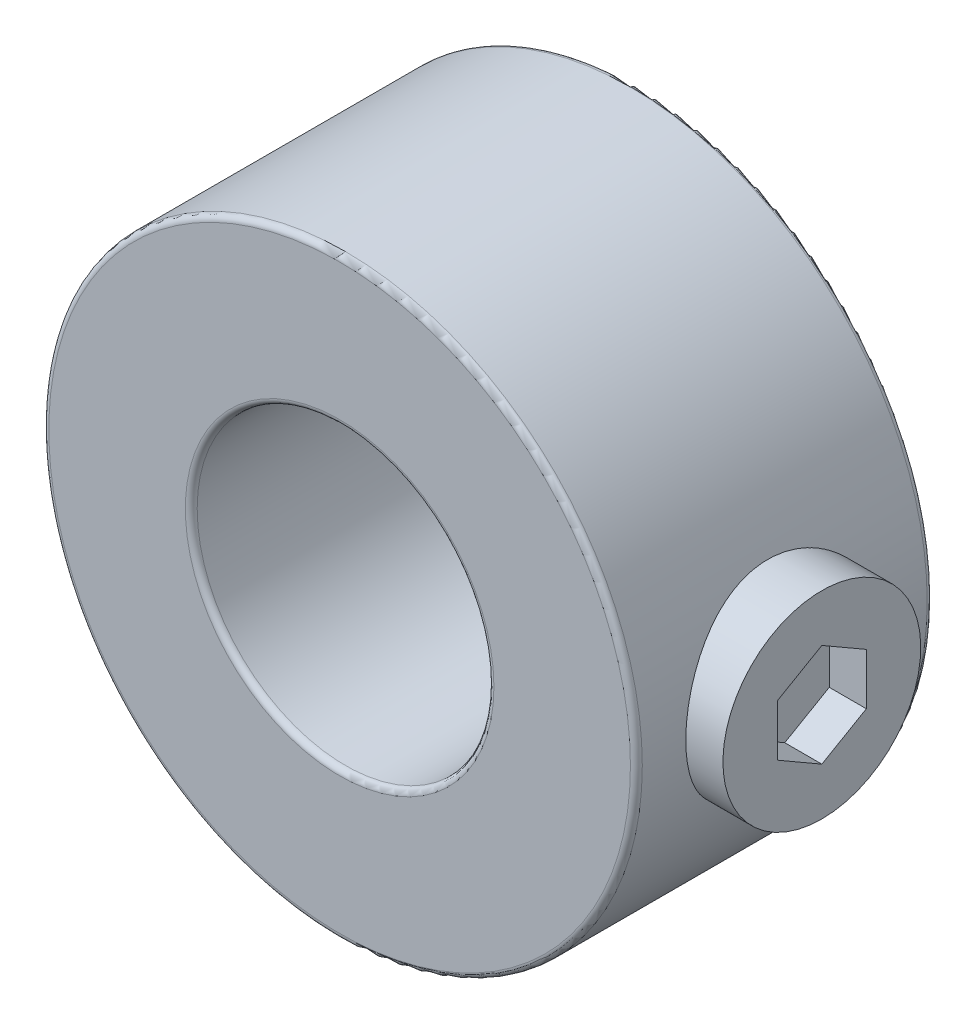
ISO-10303-21;
HEADER;
FILE_DESCRIPTION(('STEP AP214'),'2;1');
FILE_NAME('part.step','',(''),(''),'','','');
FILE_SCHEMA(('AUTOMOTIVE_DESIGN { 1 0 10303 214 1 1 1 1 }'));
ENDSEC;
DATA;
#1=APPLICATION_CONTEXT('core data for automotive mechanical design processes');
#2=APPLICATION_PROTOCOL_DEFINITION('international standard','automotive_design',2000,#1);
#3=PRODUCT_CONTEXT('',#1,'mechanical');
#4=PRODUCT('Part','Part','',(#3));
#5=PRODUCT_RELATED_PRODUCT_CATEGORY('part','',(#4));
#6=PRODUCT_DEFINITION_FORMATION('','',#4);
#7=PRODUCT_DEFINITION_CONTEXT('part definition',#1,'design');
#8=PRODUCT_DEFINITION('design','',#6,#7);
#9=PRODUCT_DEFINITION_SHAPE('','',#8);
#10=(LENGTH_UNIT() NAMED_UNIT(*) SI_UNIT(.MILLI.,.METRE.));
#11=(NAMED_UNIT(*) PLANE_ANGLE_UNIT() SI_UNIT($,.RADIAN.));
#12=(NAMED_UNIT(*) SI_UNIT($,.STERADIAN.) SOLID_ANGLE_UNIT());
#13=UNCERTAINTY_MEASURE_WITH_UNIT(LENGTH_MEASURE(1.E-05),#10,'distance_accuracy_value','');
#14=(GEOMETRIC_REPRESENTATION_CONTEXT(3) GLOBAL_UNCERTAINTY_ASSIGNED_CONTEXT((#13)) GLOBAL_UNIT_ASSIGNED_CONTEXT((#10,
#11,#12)) REPRESENTATION_CONTEXT('',''));
#15=CARTESIAN_POINT('',(0.,0.,0.));
#16=DIRECTION('',(0.,0.,1.));
#17=DIRECTION('',(1.,0.,0.));
#18=AXIS2_PLACEMENT_3D('',#15,#16,#17);
#19=CARTESIAN_POINT('',(5.95312500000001,0.,4.7625));
#20=DIRECTION('',(1.,0.,0.));
#21=DIRECTION('',(0.,1.,0.));
#22=AXIS2_PLACEMENT_3D('',#19,#20,#21);
#23=PLANE('',#22);
#24=CARTESIAN_POINT('',(5.95312500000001,0.,4.7625));
#25=DIRECTION('',(-1.,0.,0.));
#26=DIRECTION('',(0.,-1.,0.));
#27=AXIS2_PLACEMENT_3D('',#24,#25,#26);
#28=CIRCLE('',#27,3.175);
#29=CARTESIAN_POINT('',(5.95312500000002,-3.17500000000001,4.7625));
#30=VERTEX_POINT('',#29);
#31=EDGE_CURVE('E12',#30,#30,#28,.T.);
#32=ORIENTED_EDGE('',*,*,#31,.T.);
#33=EDGE_LOOP('',(#32));
#34=FACE_BOUND('',#33,.T.);
#35=ADVANCED_FACE('F42',(#34),#23,.F.);
#36=CARTESIAN_POINT('',(5.953125,0.,4.7625));
#37=DIRECTION('',(-1.,0.,0.));
#38=DIRECTION('',(0.,-1.,0.));
#39=AXIS2_PLACEMENT_3D('',#36,#37,#38);
#40=CYLINDRICAL_SURFACE('',#39,3.175);
#41=ORIENTED_EDGE('',*,*,#31,.F.);
#42=EDGE_LOOP('',(#41));
#43=FACE_BOUND('',#42,.T.);
#44=CARTESIAN_POINT('',(10.715625,0.,4.7625));
#45=DIRECTION('',(-1.,0.,0.));
#46=DIRECTION('',(0.,-1.,0.));
#47=AXIS2_PLACEMENT_3D('',#44,#45,#46);
#48=CIRCLE('',#47,3.17499999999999);
#49=CARTESIAN_POINT('',(10.715625,-3.17499999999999,4.7625));
#50=VERTEX_POINT('',#49);
#51=EDGE_CURVE('E49',#50,#50,#48,.T.);
#52=ORIENTED_EDGE('',*,*,#51,.T.);
#53=EDGE_LOOP('',(#52));
#54=FACE_BOUND('',#53,.T.);
#55=ADVANCED_FACE('F152',(#43,#54),#40,.T.);
#56=CARTESIAN_POINT('',(10.715625,0.,4.7625));
#57=DIRECTION('',(-1.,0.,0.));
#58=DIRECTION('',(0.,-1.,0.));
#59=AXIS2_PLACEMENT_3D('',#56,#57,#58);
#60=PLANE('',#59);
#61=DIRECTION('',(0.,-0.5,0.866025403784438));
#62=VECTOR('',#61,1.);
#63=CARTESIAN_POINT('',(10.715625,1.64977839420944,4.7625));
#64=LINE('',#63,#62);
#65=CARTESIAN_POINT('',(10.715625,1.64977839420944,4.7625));
#66=VERTEX_POINT('',#65);
#67=CARTESIAN_POINT('',(10.715625,0.824889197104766,6.19125));
#68=VERTEX_POINT('',#67);
#69=EDGE_CURVE('E110',#66,#68,#64,.T.);
#70=ORIENTED_EDGE('',*,*,#69,.F.);
#71=DIRECTION('',(0.,0.5,0.866025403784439));
#72=VECTOR('',#71,1.);
#73=CARTESIAN_POINT('',(10.715625,0.824889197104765,3.33375));
#74=LINE('',#73,#72);
#75=CARTESIAN_POINT('',(10.715625,0.824889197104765,3.33375));
#76=VERTEX_POINT('',#75);
#77=EDGE_CURVE('E56',#76,#66,#74,.T.);
#78=ORIENTED_EDGE('',*,*,#77,.F.);
#79=DIRECTION('',(0.,1.,0.));
#80=VECTOR('',#79,1.);
#81=CARTESIAN_POINT('',(10.715625,-0.82488919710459,3.33375));
#82=LINE('',#81,#80);
#83=CARTESIAN_POINT('',(10.715625,-0.82488919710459,3.33375));
#84=VERTEX_POINT('',#83);
#85=EDGE_CURVE('E126',#84,#76,#82,.T.);
#86=ORIENTED_EDGE('',*,*,#85,.F.);
#87=DIRECTION('',(0.,0.5,-0.866025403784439));
#88=VECTOR('',#87,1.);
#89=CARTESIAN_POINT('',(10.715625,-1.64977839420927,4.7625));
#90=LINE('',#89,#88);
#91=CARTESIAN_POINT('',(10.715625,-1.64977839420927,4.7625));
#92=VERTEX_POINT('',#91);
#93=EDGE_CURVE('E120',#92,#84,#90,.T.);
#94=ORIENTED_EDGE('',*,*,#93,.F.);
#95=DIRECTION('',(0.,-0.5,-0.866025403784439));
#96=VECTOR('',#95,1.);
#97=CARTESIAN_POINT('',(10.715625,-0.82488919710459,6.19125));
#98=LINE('',#97,#96);
#99=CARTESIAN_POINT('',(10.715625,-0.82488919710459,6.19125));
#100=VERTEX_POINT('',#99);
#101=EDGE_CURVE('E118',#100,#92,#98,.T.);
#102=ORIENTED_EDGE('',*,*,#101,.F.);
#103=DIRECTION('',(0.,-1.,0.));
#104=VECTOR('',#103,1.);
#105=CARTESIAN_POINT('',(10.715625,0.824889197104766,6.19125));
#106=LINE('',#105,#104);
#107=EDGE_CURVE('E99',#68,#100,#106,.T.);
#108=ORIENTED_EDGE('',*,*,#107,.F.);
#109=EDGE_LOOP('',(#70,#78,#86,#94,#102,#108));
#110=FACE_BOUND('',#109,.T.);
#111=ORIENTED_EDGE('',*,*,#51,.F.);
#112=EDGE_LOOP('',(#111));
#113=FACE_BOUND('',#112,.T.);
#114=ADVANCED_FACE('F114',(#110,#113),#60,.F.);
#115=CARTESIAN_POINT('',(9.52500000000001,0.824889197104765,3.33375));
#116=DIRECTION('',(0.,0.866025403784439,-0.5));
#117=DIRECTION('',(0.,0.5,0.866025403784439));
#118=AXIS2_PLACEMENT_3D('',#115,#116,#117);
#119=PLANE('',#118);
#120=ORIENTED_EDGE('',*,*,#77,.T.);
#121=DIRECTION('',(1.,0.,0.));
#122=VECTOR('',#121,1.);
#123=CARTESIAN_POINT('',(9.52500000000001,1.64977839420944,4.7625));
#124=LINE('',#123,#122);
#125=CARTESIAN_POINT('',(9.52500000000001,1.64977839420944,4.7625));
#126=VERTEX_POINT('',#125);
#127=EDGE_CURVE('E107',#126,#66,#124,.T.);
#128=ORIENTED_EDGE('',*,*,#127,.F.);
#129=DIRECTION('',(0.,0.5,0.866025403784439));
#130=VECTOR('',#129,1.);
#131=CARTESIAN_POINT('',(9.52500000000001,0.824889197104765,3.33375));
#132=LINE('',#131,#130);
#133=CARTESIAN_POINT('',(9.52500000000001,0.824889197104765,3.33375));
#134=VERTEX_POINT('',#133);
#135=EDGE_CURVE('E128',#134,#126,#132,.T.);
#136=ORIENTED_EDGE('',*,*,#135,.F.);
#137=DIRECTION('',(1.,0.,0.));
#138=VECTOR('',#137,1.);
#139=CARTESIAN_POINT('',(9.52500000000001,0.824889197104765,3.33375));
#140=LINE('',#139,#138);
#141=EDGE_CURVE('E63',#134,#76,#140,.T.);
#142=ORIENTED_EDGE('',*,*,#141,.T.);
#143=EDGE_LOOP('',(#120,#128,#136,#142));
#144=FACE_BOUND('',#143,.T.);
#145=ADVANCED_FACE('F154',(#144),#119,.F.);
#146=CARTESIAN_POINT('',(9.52500000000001,-0.82488919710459,3.33375));
#147=DIRECTION('',(0.,0.,-1.));
#148=DIRECTION('',(-1.,0.,0.));
#149=AXIS2_PLACEMENT_3D('',#146,#147,#148);
#150=PLANE('',#149);
#151=ORIENTED_EDGE('',*,*,#85,.T.);
#152=ORIENTED_EDGE('',*,*,#141,.F.);
#153=DIRECTION('',(0.,1.,0.));
#154=VECTOR('',#153,1.);
#155=CARTESIAN_POINT('',(9.52500000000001,-0.82488919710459,3.33375));
#156=LINE('',#155,#154);
#157=CARTESIAN_POINT('',(9.52500000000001,-0.82488919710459,3.33375));
#158=VERTEX_POINT('',#157);
#159=EDGE_CURVE('E140',#158,#134,#156,.T.);
#160=ORIENTED_EDGE('',*,*,#159,.F.);
#161=DIRECTION('',(1.,0.,0.));
#162=VECTOR('',#161,1.);
#163=CARTESIAN_POINT('',(9.52500000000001,-0.82488919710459,3.33375));
#164=LINE('',#163,#162);
#165=EDGE_CURVE('E144',#158,#84,#164,.T.);
#166=ORIENTED_EDGE('',*,*,#165,.T.);
#167=EDGE_LOOP('',(#151,#152,#160,#166));
#168=FACE_BOUND('',#167,.T.);
#169=ADVANCED_FACE('F160',(#168),#150,.F.);
#170=CARTESIAN_POINT('',(9.52500000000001,-1.64977839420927,4.7625));
#171=DIRECTION('',(0.,-0.866025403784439,-0.5));
#172=DIRECTION('',(0.,0.5,-0.866025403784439));
#173=AXIS2_PLACEMENT_3D('',#170,#171,#172);
#174=PLANE('',#173);
#175=ORIENTED_EDGE('',*,*,#93,.T.);
#176=ORIENTED_EDGE('',*,*,#165,.F.);
#177=DIRECTION('',(0.,0.5,-0.866025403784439));
#178=VECTOR('',#177,1.);
#179=CARTESIAN_POINT('',(9.52500000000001,-1.64977839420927,4.7625));
#180=LINE('',#179,#178);
#181=CARTESIAN_POINT('',(9.52500000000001,-1.64977839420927,4.7625));
#182=VERTEX_POINT('',#181);
#183=EDGE_CURVE('E137',#182,#158,#180,.T.);
#184=ORIENTED_EDGE('',*,*,#183,.F.);
#185=DIRECTION('',(1.,0.,0.));
#186=VECTOR('',#185,1.);
#187=CARTESIAN_POINT('',(9.52500000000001,-1.64977839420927,4.7625));
#188=LINE('',#187,#186);
#189=EDGE_CURVE('E146',#182,#92,#188,.T.);
#190=ORIENTED_EDGE('',*,*,#189,.T.);
#191=EDGE_LOOP('',(#175,#176,#184,#190));
#192=FACE_BOUND('',#191,.T.);
#193=ADVANCED_FACE('F191',(#192),#174,.F.);
#194=CARTESIAN_POINT('',(9.52500000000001,-0.82488919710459,6.19125));
#195=DIRECTION('',(0.,-0.866025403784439,0.5));
#196=DIRECTION('',(0.,-0.5,-0.866025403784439));
#197=AXIS2_PLACEMENT_3D('',#194,#195,#196);
#198=PLANE('',#197);
#199=ORIENTED_EDGE('',*,*,#101,.T.);
#200=ORIENTED_EDGE('',*,*,#189,.F.);
#201=DIRECTION('',(0.,-0.5,-0.866025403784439));
#202=VECTOR('',#201,1.);
#203=CARTESIAN_POINT('',(9.52500000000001,-0.82488919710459,6.19125));
#204=LINE('',#203,#202);
#205=CARTESIAN_POINT('',(9.52500000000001,-0.82488919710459,6.19125));
#206=VERTEX_POINT('',#205);
#207=EDGE_CURVE('E134',#206,#182,#204,.T.);
#208=ORIENTED_EDGE('',*,*,#207,.F.);
#209=DIRECTION('',(1.,0.,0.));
#210=VECTOR('',#209,1.);
#211=CARTESIAN_POINT('',(9.52500000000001,-0.82488919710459,6.19125));
#212=LINE('',#211,#210);
#213=EDGE_CURVE('E106',#206,#100,#212,.T.);
#214=ORIENTED_EDGE('',*,*,#213,.T.);
#215=EDGE_LOOP('',(#199,#200,#208,#214));
#216=FACE_BOUND('',#215,.T.);
#217=ADVANCED_FACE('F200',(#216),#198,.F.);
#218=CARTESIAN_POINT('',(9.52500000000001,0.824889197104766,6.19125));
#219=DIRECTION('',(0.,0.,1.));
#220=DIRECTION('',(1.,0.,0.));
#221=AXIS2_PLACEMENT_3D('',#218,#219,#220);
#222=PLANE('',#221);
#223=ORIENTED_EDGE('',*,*,#107,.T.);
#224=ORIENTED_EDGE('',*,*,#213,.F.);
#225=DIRECTION('',(0.,-1.,0.));
#226=VECTOR('',#225,1.);
#227=CARTESIAN_POINT('',(9.52500000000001,0.824889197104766,6.19125));
#228=LINE('',#227,#226);
#229=CARTESIAN_POINT('',(9.52500000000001,0.824889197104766,6.19125));
#230=VERTEX_POINT('',#229);
#231=EDGE_CURVE('E102',#230,#206,#228,.T.);
#232=ORIENTED_EDGE('',*,*,#231,.F.);
#233=DIRECTION('',(1.,0.,0.));
#234=VECTOR('',#233,1.);
#235=CARTESIAN_POINT('',(9.52500000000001,0.824889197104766,6.19125));
#236=LINE('',#235,#234);
#237=EDGE_CURVE('E95',#230,#68,#236,.T.);
#238=ORIENTED_EDGE('',*,*,#237,.T.);
#239=EDGE_LOOP('',(#223,#224,#232,#238));
#240=FACE_BOUND('',#239,.T.);
#241=ADVANCED_FACE('F97',(#240),#222,.F.);
#242=CARTESIAN_POINT('',(9.52500000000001,1.64977839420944,4.7625));
#243=DIRECTION('',(0.,0.866025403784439,0.5));
#244=DIRECTION('',(0.,-0.5,0.866025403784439));
#245=AXIS2_PLACEMENT_3D('',#242,#243,#244);
#246=PLANE('',#245);
#247=ORIENTED_EDGE('',*,*,#69,.T.);
#248=ORIENTED_EDGE('',*,*,#237,.F.);
#249=DIRECTION('',(0.,-0.5,0.866025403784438));
#250=VECTOR('',#249,1.);
#251=CARTESIAN_POINT('',(9.52500000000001,1.64977839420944,4.7625));
#252=LINE('',#251,#250);
#253=EDGE_CURVE('E131',#126,#230,#252,.T.);
#254=ORIENTED_EDGE('',*,*,#253,.F.);
#255=ORIENTED_EDGE('',*,*,#127,.T.);
#256=EDGE_LOOP('',(#247,#248,#254,#255));
#257=FACE_BOUND('',#256,.T.);
#258=ADVANCED_FACE('F111',(#257),#246,.F.);
#259=CARTESIAN_POINT('',(9.52500000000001,2.47466759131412,6.19125));
#260=DIRECTION('',(1.,0.,0.));
#261=DIRECTION('',(0.,0.,-1.));
#262=AXIS2_PLACEMENT_3D('',#259,#260,#261);
#263=PLANE('',#262);
#264=ORIENTED_EDGE('',*,*,#135,.T.);
#265=ORIENTED_EDGE('',*,*,#253,.T.);
#266=ORIENTED_EDGE('',*,*,#231,.T.);
#267=ORIENTED_EDGE('',*,*,#207,.T.);
#268=ORIENTED_EDGE('',*,*,#183,.T.);
#269=ORIENTED_EDGE('',*,*,#159,.T.);
#270=EDGE_LOOP('',(#264,#265,#266,#267,#268,#269));
#271=FACE_BOUND('',#270,.T.);
#272=ADVANCED_FACE('F227',(#271),#263,.T.);
#273=CLOSED_SHELL('',(#35,#55,#114,#145,#169,#193,#217,#241,#258,#272));
#274=MANIFOLD_SOLID_BREP('B2',#273);
#275=CARTESIAN_POINT('',(0.,0.,9.525));
#276=DIRECTION('',(0.,0.,1.));
#277=DIRECTION('',(1.,0.,0.));
#278=AXIS2_PLACEMENT_3D('',#275,#276,#277);
#279=PLANE('',#278);
#280=CARTESIAN_POINT('',(0.,0.,9.525));
#281=DIRECTION('',(0.,0.,1.));
#282=DIRECTION('',(1.,0.,0.));
#283=AXIS2_PLACEMENT_3D('',#280,#281,#282);
#284=CIRCLE('',#283,4.953);
#285=CARTESIAN_POINT('',(4.953,0.,9.525));
#286=VERTEX_POINT('',#285);
#287=EDGE_CURVE('E259',#286,#286,#284,.F.);
#288=ORIENTED_EDGE('',*,*,#287,.T.);
#289=EDGE_LOOP('',(#288));
#290=FACE_BOUND('',#289,.T.);
#291=CARTESIAN_POINT('',(0.,0.,9.525));
#292=DIRECTION('',(0.,0.,1.));
#293=DIRECTION('',(1.,0.,0.));
#294=AXIS2_PLACEMENT_3D('',#291,#292,#293);
#295=CIRCLE('',#294,9.33450000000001);
#296=CARTESIAN_POINT('',(9.33450000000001,0.,9.525));
#297=VERTEX_POINT('',#296);
#298=EDGE_CURVE('E263',#297,#297,#295,.T.);
#299=ORIENTED_EDGE('',*,*,#298,.T.);
#300=EDGE_LOOP('',(#299));
#301=FACE_BOUND('',#300,.T.);
#302=ADVANCED_FACE('F247',(#290,#301),#279,.T.);
#303=CARTESIAN_POINT('',(0.,0.,0.));
#304=DIRECTION('',(0.,0.,1.));
#305=DIRECTION('',(1.,0.,0.));
#306=AXIS2_PLACEMENT_3D('',#303,#304,#305);
#307=PLANE('',#306);
#308=CARTESIAN_POINT('',(0.,0.,0.));
#309=DIRECTION('',(0.,0.,1.));
#310=DIRECTION('',(1.,0.,0.));
#311=AXIS2_PLACEMENT_3D('',#308,#309,#310);
#312=CIRCLE('',#311,4.953);
#313=CARTESIAN_POINT('',(4.953,0.,0.));
#314=VERTEX_POINT('',#313);
#315=EDGE_CURVE('E274',#314,#314,#312,.T.);
#316=ORIENTED_EDGE('',*,*,#315,.T.);
#317=EDGE_LOOP('',(#316));
#318=FACE_BOUND('',#317,.T.);
#319=CARTESIAN_POINT('',(0.,0.,0.));
#320=DIRECTION('',(0.,0.,1.));
#321=DIRECTION('',(1.,0.,0.));
#322=AXIS2_PLACEMENT_3D('',#319,#320,#321);
#323=CIRCLE('',#322,9.33450000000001);
#324=CARTESIAN_POINT('',(9.33450000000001,0.,0.));
#325=VERTEX_POINT('',#324);
#326=EDGE_CURVE('E277',#325,#325,#323,.F.);
#327=ORIENTED_EDGE('',*,*,#326,.T.);
#328=EDGE_LOOP('',(#327));
#329=FACE_BOUND('',#328,.T.);
#330=ADVANCED_FACE('F318',(#318,#329),#307,.F.);
#331=CARTESIAN_POINT('',(0.,0.,9.525));
#332=DIRECTION('',(0.,0.,-1.));
#333=DIRECTION('',(-1.,0.,0.));
#334=AXIS2_PLACEMENT_3D('',#331,#332,#333);
#335=CYLINDRICAL_SURFACE('',#334,9.52500000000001);
#336=CARTESIAN_POINT('',(0.,0.,0.1905));
#337=DIRECTION('',(0.,0.,1.));
#338=DIRECTION('',(1.,0.,0.));
#339=AXIS2_PLACEMENT_3D('',#336,#337,#338);
#340=CIRCLE('',#339,9.52500000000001);
#341=CARTESIAN_POINT('',(9.52500000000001,0.,0.1905));
#342=VERTEX_POINT('',#341);
#343=EDGE_CURVE('E41',#342,#342,#340,.T.);
#344=ORIENTED_EDGE('',*,*,#343,.T.);
#345=EDGE_LOOP('',(#344));
#346=FACE_BOUND('',#345,.T.);
#347=CARTESIAN_POINT('',(0.,0.,9.3345));
#348=DIRECTION('',(0.,0.,1.));
#349=DIRECTION('',(1.,0.,0.));
#350=AXIS2_PLACEMENT_3D('',#347,#348,#349);
#351=CIRCLE('',#350,9.52500000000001);
#352=CARTESIAN_POINT('',(9.52500000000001,0.,9.3345));
#353=VERTEX_POINT('',#352);
#354=EDGE_CURVE('E255',#353,#353,#351,.F.);
#355=ORIENTED_EDGE('',*,*,#354,.T.);
#356=EDGE_LOOP('',(#355));
#357=FACE_BOUND('',#356,.T.);
#358=CARTESIAN_POINT('',(9.525,0.,1.5875));
#359=CARTESIAN_POINT('',(9.52500048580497,-0.173238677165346,1.58749919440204));
#360=CARTESIAN_POINT('',(9.52023018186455,-0.346472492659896,1.60172484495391));
#361=CARTESIAN_POINT('',(9.50167042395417,-0.687837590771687,1.65807742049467));
#362=CARTESIAN_POINT('',(9.48788003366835,-0.855968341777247,1.70020724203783));
#363=CARTESIAN_POINT('',(9.45277852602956,-1.18215660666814,1.81076359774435));
#364=CARTESIAN_POINT('',(9.4314799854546,-1.34023044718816,1.87914617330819));
#365=CARTESIAN_POINT('',(9.38353615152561,-1.64266542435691,2.04006822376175));
#366=CARTESIAN_POINT('',(9.35688980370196,-1.78702384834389,2.13261246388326));
#367=CARTESIAN_POINT('',(9.30002249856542,-2.0629298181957,2.34259693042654));
#368=CARTESIAN_POINT('',(9.26971591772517,-2.19393674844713,2.46072416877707));
#369=CARTESIAN_POINT('',(9.20941499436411,-2.43469379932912,2.71706071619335));
#370=CARTESIAN_POINT('',(9.17942072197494,-2.54443923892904,2.85527443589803));
#371=CARTESIAN_POINT('',(9.12219830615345,-2.74264419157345,3.15272774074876));
#372=CARTESIAN_POINT('',(9.09507449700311,-2.83040092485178,3.31245762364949));
#373=CARTESIAN_POINT('',(9.04796594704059,-2.97757492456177,3.64545909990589));
#374=CARTESIAN_POINT('',(9.02797902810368,-3.03700083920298,3.81872654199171));
#375=CARTESIAN_POINT('',(8.99830887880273,-3.12379824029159,4.16773747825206));
#376=CARTESIAN_POINT('',(8.98830104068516,-3.15218269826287,4.34320063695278));
#377=CARTESIAN_POINT('',(8.97876209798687,-3.17925806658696,4.69666241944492));
#378=CARTESIAN_POINT('',(8.97922775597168,-3.17795815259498,4.87466024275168));
#379=CARTESIAN_POINT('',(8.99029872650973,-3.14648819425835,5.21949880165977));
#380=CARTESIAN_POINT('',(9.00043970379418,-3.11764017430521,5.38647767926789));
#381=CARTESIAN_POINT('',(9.0289588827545,-3.0340495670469,5.7130741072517));
#382=CARTESIAN_POINT('',(9.04733807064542,-2.97930387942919,5.87269077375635));
#383=CARTESIAN_POINT('',(9.09059367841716,-2.84460650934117,6.18303547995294));
#384=CARTESIAN_POINT('',(9.11556996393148,-2.76426310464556,6.33357898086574));
#385=CARTESIAN_POINT('',(9.16916373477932,-2.58092291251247,6.61946513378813));
#386=CARTESIAN_POINT('',(9.19778227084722,-2.47791958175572,6.75480337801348));
#387=CARTESIAN_POINT('',(9.25726270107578,-2.2458341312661,7.01386582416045));
#388=CARTESIAN_POINT('',(9.28816371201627,-2.11567125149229,7.1366148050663));
#389=CARTESIAN_POINT('',(9.34742029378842,-1.83622813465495,7.35879677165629));
#390=CARTESIAN_POINT('',(9.37577562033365,-1.68694606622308,7.45822752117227));
#391=CARTESIAN_POINT('',(9.42711817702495,-1.3714336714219,7.63173575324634));
#392=CARTESIAN_POINT('',(9.45004936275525,-1.20504990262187,7.70555193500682));
#393=CARTESIAN_POINT('',(9.48755300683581,-0.86127933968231,7.82384507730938));
#394=CARTESIAN_POINT('',(9.50212836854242,-0.683896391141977,7.86833222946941));
#395=CARTESIAN_POINT('',(9.52079715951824,-0.33141865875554,7.92497673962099));
#396=CARTESIAN_POINT('',(9.52531755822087,-0.156557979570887,7.93845189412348));
#397=CARTESIAN_POINT('',(9.52464766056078,0.192960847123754,7.93644376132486));
#398=CARTESIAN_POINT('',(9.51945900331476,0.36761902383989,7.92096536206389));
#399=CARTESIAN_POINT('',(9.50023578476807,0.706500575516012,7.86253219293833));
#400=CARTESIAN_POINT('',(9.48646180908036,0.870879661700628,7.82038629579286));
#401=CARTESIAN_POINT('',(9.45171613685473,1.19016766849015,7.71082581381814));
#402=CARTESIAN_POINT('',(9.43074352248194,1.34507537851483,7.64340800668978));
#403=CARTESIAN_POINT('',(9.38304356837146,1.64556534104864,7.4832513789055));
#404=CARTESIAN_POINT('',(9.35617936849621,1.79079512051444,7.38989316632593));
#405=CARTESIAN_POINT('',(9.29974181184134,2.06395583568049,7.18123357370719));
#406=CARTESIAN_POINT('',(9.27016762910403,2.19188146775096,7.06592549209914));
#407=CARTESIAN_POINT('',(9.20993992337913,2.432851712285,6.81044246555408));
#408=CARTESIAN_POINT('',(9.17929841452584,2.54495607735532,6.66937570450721));
#409=CARTESIAN_POINT('',(9.12177415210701,2.74401763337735,6.36977527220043));
#410=CARTESIAN_POINT('',(9.09489142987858,2.83097461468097,6.2112414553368));
#411=CARTESIAN_POINT('',(9.04819093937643,2.97687025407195,5.88113817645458));
#412=CARTESIAN_POINT('',(9.02835890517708,3.03586556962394,5.70959589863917));
#413=CARTESIAN_POINT('',(8.99829392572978,3.12386556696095,5.35819778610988));
#414=CARTESIAN_POINT('',(8.98805665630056,3.15288375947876,5.17834573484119));
#415=CARTESIAN_POINT('',(8.97883201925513,3.17905219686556,4.82537422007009));
#416=CARTESIAN_POINT('',(8.97929370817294,3.17776306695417,4.65238356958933));
#417=CARTESIAN_POINT('',(8.9900528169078,3.1471942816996,4.30922088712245));
#418=CARTESIAN_POINT('',(9.00034965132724,3.11791629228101,4.13904868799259));
#419=CARTESIAN_POINT('',(9.02920864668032,3.03330550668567,3.80956926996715));
#420=CARTESIAN_POINT('',(9.04761011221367,2.97847812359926,3.65011708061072));
#421=CARTESIAN_POINT('',(9.09054566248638,2.8447344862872,3.34255298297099));
#422=CARTESIAN_POINT('',(9.11508110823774,2.76581288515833,3.19444360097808));
#423=CARTESIAN_POINT('',(9.16885482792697,2.58210269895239,2.90676434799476));
#424=CARTESIAN_POINT('',(9.19825159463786,2.47633567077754,2.76784910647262));
#425=CARTESIAN_POINT('',(9.25777156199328,2.24359115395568,2.50923484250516));
#426=CARTESIAN_POINT('',(9.28789496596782,2.11660766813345,2.38954127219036));
#427=CARTESIAN_POINT('',(9.34688346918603,1.83909194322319,2.16806649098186));
#428=CARTESIAN_POINT('',(9.3756537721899,1.68783480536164,2.06716519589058));
#429=CARTESIAN_POINT('',(9.42740021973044,1.36955960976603,1.8923303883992));
#430=CARTESIAN_POINT('',(9.45037784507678,1.20254559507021,1.81838998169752));
#431=CARTESIAN_POINT('',(9.48707510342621,0.865167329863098,1.70268381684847));
#432=CARTESIAN_POINT('',(9.5011624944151,0.695286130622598,1.65962816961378));
#433=CARTESIAN_POINT('',(9.52012342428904,0.350267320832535,1.60204060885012));
#434=CARTESIAN_POINT('',(9.52499950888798,0.17513117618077,1.5875008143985));
#435=CARTESIAN_POINT('',(9.525,0.,1.5875));
#436=B_SPLINE_CURVE_WITH_KNOTS('',3,(#358,#359,#360,#361,#362,#363,#364,#365,#366,#367,#368,
#369,#370,#371,#372,#373,#374,#375,#376,#377,#378,#379,#380,#381,#382,#383,#384,#385,#386,#387,
#388,#389,#390,#391,#392,#393,#394,#395,#396,#397,#398,#399,#400,#401,#402,#403,#404,#405,#406,
#407,#408,#409,#410,#411,#412,#413,#414,#415,#416,#417,#418,#419,#420,#421,#422,#423,#424,#425,
#426,#427,#428,#429,#430,#431,#432,#433,#434,#435),.UNSPECIFIED.,.T.,.F.,(4,2,2,2,2,2,2,2,2,2,2,
2,2,2,2,2,2,2,2,2,2,2,2,2,2,2,2,2,2,2,2,2,2,2,2,2,2,2,4),(0.,0.519071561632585,1.03819701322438,
1.55645698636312,2.07481924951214,2.6093637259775,3.14402575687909,3.69406121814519,
4.24392866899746,4.77526114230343,5.30642937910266,5.81332424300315,6.32027980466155,
6.8353994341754,7.35066800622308,7.8928374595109,8.43505888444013,8.98265937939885,
9.53006948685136,10.0537512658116,10.5773446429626,11.0857715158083,11.5942632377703,
12.1161301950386,12.638156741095,13.1839024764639,13.7296527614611,14.274292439,
14.8186865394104,15.3351123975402,15.8515075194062,16.3580948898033,16.8647947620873,
17.3936046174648,17.92256420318,18.4721392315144,19.0215736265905,19.5464607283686,
20.0712027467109),.UNSPECIFIED.);
#437=CARTESIAN_POINT('',(9.525,0.,1.5875));
#438=VERTEX_POINT('',#437);
#439=EDGE_CURVE('E280',#438,#438,#436,.T.);
#440=ORIENTED_EDGE('',*,*,#439,.T.);
#441=EDGE_LOOP('',(#440));
#442=FACE_BOUND('',#441,.T.);
#443=ADVANCED_FACE('F249',(#346,#357,#442),#335,.T.);
#444=CARTESIAN_POINT('',(0.,0.,9.525));
#445=DIRECTION('',(0.,0.,-1.));
#446=DIRECTION('',(-1.,0.,0.));
#447=AXIS2_PLACEMENT_3D('',#444,#445,#446);
#448=CYLINDRICAL_SURFACE('',#447,4.7625);
#449=CARTESIAN_POINT('',(0.,0.,0.1905));
#450=DIRECTION('',(0.,0.,1.));
#451=DIRECTION('',(1.,0.,0.));
#452=AXIS2_PLACEMENT_3D('',#449,#450,#451);
#453=CIRCLE('',#452,4.7625);
#454=CARTESIAN_POINT('',(4.7625,0.,0.1905));
#455=VERTEX_POINT('',#454);
#456=EDGE_CURVE('E268',#455,#455,#453,.F.);
#457=ORIENTED_EDGE('',*,*,#456,.T.);
#458=EDGE_LOOP('',(#457));
#459=FACE_BOUND('',#458,.T.);
#460=CARTESIAN_POINT('',(0.,0.,9.3345));
#461=DIRECTION('',(0.,0.,1.));
#462=DIRECTION('',(1.,0.,0.));
#463=AXIS2_PLACEMENT_3D('',#460,#461,#462);
#464=CIRCLE('',#463,4.7625);
#465=CARTESIAN_POINT('',(4.7625,0.,9.3345));
#466=VERTEX_POINT('',#465);
#467=EDGE_CURVE('E271',#466,#466,#464,.T.);
#468=ORIENTED_EDGE('',*,*,#467,.T.);
#469=EDGE_LOOP('',(#468));
#470=FACE_BOUND('',#469,.T.);
#471=CARTESIAN_POINT('',(4.7625,0.,1.5875));
#472=CARTESIAN_POINT('',(4.76249829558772,-0.159513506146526,1.58750214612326));
#473=CARTESIAN_POINT('',(4.75441585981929,-0.319036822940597,1.59958798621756));
#474=CARTESIAN_POINT('',(4.72288699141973,-0.632990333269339,1.6471842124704));
#475=CARTESIAN_POINT('',(4.6994332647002,-0.787418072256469,1.6827057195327));
#476=CARTESIAN_POINT('',(4.63947623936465,-1.08618661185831,1.77499621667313));
#477=CARTESIAN_POINT('',(4.60303407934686,-1.23057094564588,1.83166571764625));
#478=CARTESIAN_POINT('',(4.52002748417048,-1.50719688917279,1.96383803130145));
#479=CARTESIAN_POINT('',(4.47346157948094,-1.63943673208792,2.03934357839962));
#480=CARTESIAN_POINT('',(4.36923384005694,-1.9006894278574,2.21401790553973));
#481=CARTESIAN_POINT('',(4.31096574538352,-2.0284762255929,2.31465098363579));
#482=CARTESIAN_POINT('',(4.19071922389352,-2.26651828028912,2.53322144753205));
#483=CARTESIAN_POINT('',(4.12873555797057,-2.37674794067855,2.65118362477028));
#484=CARTESIAN_POINT('',(3.99618620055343,-2.59432897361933,2.92267063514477));
#485=CARTESIAN_POINT('',(3.92580920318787,-2.69848308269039,3.07886997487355));
#486=CARTESIAN_POINT('',(3.79546083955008,-2.87893691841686,3.41052686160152));
#487=CARTESIAN_POINT('',(3.73547157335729,-2.95528481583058,3.58595041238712));
#488=CARTESIAN_POINT('',(3.65087323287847,-3.0587003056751,3.90002917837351));
#489=CARTESIAN_POINT('',(3.62104984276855,-3.09363184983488,4.03467641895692));
#490=CARTESIAN_POINT('',(3.57597026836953,-3.14564105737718,4.30965690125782));
#491=CARTESIAN_POINT('',(3.56068897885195,-3.16274949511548,4.44997990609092));
#492=CARTESIAN_POINT('',(3.54705611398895,-3.17803790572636,4.73309121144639));
#493=CARTESIAN_POINT('',(3.54877374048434,-3.17614050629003,4.87588722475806));
#494=CARTESIAN_POINT('',(3.56901393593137,-3.1533716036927,5.15879552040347));
#495=CARTESIAN_POINT('',(3.58755074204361,-3.13248402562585,5.29890542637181));
#496=CARTESIAN_POINT('',(3.63739407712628,-3.07443178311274,5.5665164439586));
#497=CARTESIAN_POINT('',(3.66810112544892,-3.03802591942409,5.69430112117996));
#498=CARTESIAN_POINT('',(3.73871526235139,-2.95068813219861,5.94205010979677));
#499=CARTESIAN_POINT('',(3.77862537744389,-2.89975142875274,6.06201183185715));
#500=CARTESIAN_POINT('',(3.87293161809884,-2.77294687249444,6.31670281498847));
#501=CARTESIAN_POINT('',(3.92862304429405,-2.69411533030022,6.44947259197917));
#502=CARTESIAN_POINT('',(4.04322816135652,-2.51886974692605,6.70144614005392));
#503=CARTESIAN_POINT('',(4.10214576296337,-2.42243402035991,6.82063288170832));
#504=CARTESIAN_POINT('',(4.23137558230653,-2.19045099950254,7.06841129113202));
#505=CARTESIAN_POINT('',(4.30140657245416,-2.05095377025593,7.19349280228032));
#506=CARTESIAN_POINT('',(4.43258734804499,-1.74943769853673,7.41869943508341));
#507=CARTESIAN_POINT('',(4.493745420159,-1.58744015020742,7.51884790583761));
#508=CARTESIAN_POINT('',(4.59018328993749,-1.2777118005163,7.67314587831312));
#509=CARTESIAN_POINT('',(4.62818577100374,-1.13340775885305,7.73246383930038));
#510=CARTESIAN_POINT('',(4.69118503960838,-0.835082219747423,7.82971656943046));
#511=CARTESIAN_POINT('',(4.71619281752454,-0.681069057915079,7.86766941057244));
#512=CARTESIAN_POINT('',(4.75100462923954,-0.366689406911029,7.92029334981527));
#513=CARTESIAN_POINT('',(4.76074299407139,-0.206298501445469,7.93486389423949));
#514=CARTESIAN_POINT('',(4.76381945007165,0.115000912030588,7.9394797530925));
#515=CARTESIAN_POINT('',(4.75715868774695,0.275909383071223,7.92952678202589));
#516=CARTESIAN_POINT('',(4.72915598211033,0.581748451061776,7.88729681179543));
#517=CARTESIAN_POINT('',(4.70887816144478,0.72700744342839,7.85663703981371));
#518=CARTESIAN_POINT('',(4.65643038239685,1.00983477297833,7.77621684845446));
#519=CARTESIAN_POINT('',(4.62425852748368,1.14740187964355,7.72645338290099));
#520=CARTESIAN_POINT('',(4.54812959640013,1.42028029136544,7.60626447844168));
#521=CARTESIAN_POINT('',(4.50357668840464,1.55495019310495,7.53477005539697));
#522=CARTESIAN_POINT('',(4.40692945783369,1.81083430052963,7.37483715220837));
#523=CARTESIAN_POINT('',(4.35483048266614,1.93204012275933,7.286388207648));
#524=CARTESIAN_POINT('',(4.23790342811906,2.17781894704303,7.07928500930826));
#525=CARTESIAN_POINT('',(4.172365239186,2.29989360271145,6.95806606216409));
#526=CARTESIAN_POINT('',(4.04131737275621,2.52307674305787,6.69748560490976));
#527=CARTESIAN_POINT('',(3.97580774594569,2.62417073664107,6.55811166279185));
#528=CARTESIAN_POINT('',(3.85666740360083,2.79598082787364,6.275161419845));
#529=CARTESIAN_POINT('',(3.80250060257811,2.86854322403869,6.1329378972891));
#530=CARTESIAN_POINT('',(3.70584371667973,2.99237739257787,5.83585216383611));
#531=CARTESIAN_POINT('',(3.66333266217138,3.04368748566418,5.6810133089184));
#532=CARTESIAN_POINT('',(3.60256467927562,3.11524401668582,5.39025387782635));
#533=CARTESIAN_POINT('',(3.58132059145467,3.13941774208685,5.25593975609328));
#534=CARTESIAN_POINT('',(3.55408653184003,3.17022488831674,4.98383991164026));
#535=CARTESIAN_POINT('',(3.54807999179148,3.17687736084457,4.84605812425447));
#536=CARTESIAN_POINT('',(3.55225668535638,3.17220478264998,4.57097916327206));
#537=CARTESIAN_POINT('',(3.56244950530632,3.16086908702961,4.43368232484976));
#538=CARTESIAN_POINT('',(3.59744096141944,3.12097725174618,4.16346708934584));
#539=CARTESIAN_POINT('',(3.6222590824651,3.09239813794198,4.03055478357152));
#540=CARTESIAN_POINT('',(3.69136350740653,3.00978981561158,3.73743377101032));
#541=CARTESIAN_POINT('',(3.73907521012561,2.9510082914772,3.57938867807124));
#542=CARTESIAN_POINT('',(3.84527739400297,2.81121528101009,3.27741347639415));
#543=CARTESIAN_POINT('',(3.90378297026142,2.7301725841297,3.1335035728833));
#544=CARTESIAN_POINT('',(4.02617059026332,2.54632873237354,2.85864450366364));
#545=CARTESIAN_POINT('',(4.09013111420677,2.44315837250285,2.72797893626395));
#546=CARTESIAN_POINT('',(4.21685775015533,2.21726660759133,2.48390861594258));
#547=CARTESIAN_POINT('',(4.27962348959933,2.09453921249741,2.37050917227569));
#548=CARTESIAN_POINT('',(4.37333498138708,1.88738506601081,2.20758141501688));
#549=CARTESIAN_POINT('',(4.40641312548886,1.8090134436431,2.15147238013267));
#550=CARTESIAN_POINT('',(4.46961905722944,1.64665981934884,2.04616220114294));
#551=CARTESIAN_POINT('',(4.49974819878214,1.56268042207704,1.99695788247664));
#552=CARTESIAN_POINT('',(4.55616827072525,1.38960715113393,1.90607643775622));
#553=CARTESIAN_POINT('',(4.58246276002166,1.30051812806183,1.86439232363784));
#554=CARTESIAN_POINT('',(4.6304205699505,1.11782960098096,1.78914327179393));
#555=CARTESIAN_POINT('',(4.65208551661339,1.02423169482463,1.75557548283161));
#556=CARTESIAN_POINT('',(4.70058109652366,0.780235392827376,1.68095860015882));
#557=CARTESIAN_POINT('',(4.72362103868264,0.627104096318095,1.64607234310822));
#558=CARTESIAN_POINT('',(4.75457565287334,0.315982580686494,1.59935063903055));
#559=CARTESIAN_POINT('',(4.76250168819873,0.157996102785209,1.58749787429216));
#560=CARTESIAN_POINT('',(4.7625,0.,1.5875));
#561=B_SPLINE_CURVE_WITH_KNOTS('',3,(#471,#472,#473,#474,#475,#476,#477,#478,#479,#480,#481,
#482,#483,#484,#485,#486,#487,#488,#489,#490,#491,#492,#493,#494,#495,#496,#497,#498,#499,#500,
#501,#502,#503,#504,#505,#506,#507,#508,#509,#510,#511,#512,#513,#514,#515,#516,#517,#518,#519,
#520,#521,#522,#523,#524,#525,#526,#527,#528,#529,#530,#531,#532,#533,#534,#535,#536,#537,#538,
#539,#540,#541,#542,#543,#544,#545,#546,#547,#548,#549,#550,#551,#552,#553,#554,#555,#556,#557,
#558,#559,#560),.UNSPECIFIED.,.T.,.F.,(4,2,2,2,2,2,2,2,2,2,2,2,2,2,2,2,2,2,2,2,2,2,2,2,2,2,2,2,
2,2,2,2,2,2,2,2,2,2,2,2,2,2,2,2,4),(0.,0.477921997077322,0.956070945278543,1.43199826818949,
1.90799472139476,2.42438283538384,2.94151703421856,3.54023109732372,4.13790297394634,
4.56300988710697,4.98738156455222,5.41348154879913,5.83994255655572,6.24758818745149,
6.6553680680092,7.14609274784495,7.63742604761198,8.23466340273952,8.83133933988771,
9.31106989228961,9.79039404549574,10.2717740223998,10.7531203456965,11.2006552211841,
11.6482614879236,12.1229810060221,12.5979944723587,13.1481222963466,13.6986288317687,
14.2025677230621,14.7055939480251,15.1181442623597,15.5302458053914,15.9425913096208,
16.3554874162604,16.8784049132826,17.4020593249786,17.9352455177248,18.4685953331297,
18.7739424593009,19.0791487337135,19.3840699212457,19.6888838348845,20.1626158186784,
20.635991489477),.UNSPECIFIED.);
#562=CARTESIAN_POINT('',(4.7625,0.,1.5875));
#563=VERTEX_POINT('',#562);
#564=EDGE_CURVE('E281',#563,#563,#561,.T.);
#565=ORIENTED_EDGE('',*,*,#564,.F.);
#566=EDGE_LOOP('',(#565));
#567=FACE_BOUND('',#566,.T.);
#568=ADVANCED_FACE('F290',(#459,#470,#567),#448,.F.);
#569=CARTESIAN_POINT('',(-8.98025612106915,0.,4.7625));
#570=DIRECTION('',(1.,0.,0.));
#571=DIRECTION('',(0.,0.,-1.));
#572=AXIS2_PLACEMENT_3D('',#569,#570,#571);
#573=CYLINDRICAL_SURFACE('',#572,3.175);
#574=ORIENTED_EDGE('',*,*,#564,.T.);
#575=EDGE_LOOP('',(#574));
#576=FACE_BOUND('',#575,.T.);
#577=ORIENTED_EDGE('',*,*,#439,.F.);
#578=EDGE_LOOP('',(#577));
#579=FACE_BOUND('',#578,.T.);
#580=ADVANCED_FACE('F293',(#576,#579),#573,.F.);
#581=CARTESIAN_POINT('',(0.,0.,0.1905));
#582=DIRECTION('',(0.,0.,1.));
#583=DIRECTION('',(1.,0.,0.));
#584=AXIS2_PLACEMENT_3D('',#581,#582,#583);
#585=TOROIDAL_SURFACE('',#584,4.953,0.1905);
#586=ORIENTED_EDGE('',*,*,#456,.F.);
#587=EDGE_LOOP('',(#586));
#588=FACE_BOUND('',#587,.T.);
#589=ORIENTED_EDGE('',*,*,#315,.F.);
#590=EDGE_LOOP('',(#589));
#591=FACE_BOUND('',#590,.T.);
#592=ADVANCED_FACE('F297',(#588,#591),#585,.T.);
#593=CARTESIAN_POINT('',(0.,0.,9.3345));
#594=DIRECTION('',(0.,0.,1.));
#595=DIRECTION('',(1.,0.,0.));
#596=AXIS2_PLACEMENT_3D('',#593,#594,#595);
#597=TOROIDAL_SURFACE('',#596,4.953,0.1905);
#598=ORIENTED_EDGE('',*,*,#287,.F.);
#599=EDGE_LOOP('',(#598));
#600=FACE_BOUND('',#599,.T.);
#601=ORIENTED_EDGE('',*,*,#467,.F.);
#602=EDGE_LOOP('',(#601));
#603=FACE_BOUND('',#602,.T.);
#604=ADVANCED_FACE('F302',(#600,#603),#597,.T.);
#605=CARTESIAN_POINT('',(0.,0.,0.1905));
#606=DIRECTION('',(0.,0.,1.));
#607=DIRECTION('',(1.,0.,0.));
#608=AXIS2_PLACEMENT_3D('',#605,#606,#607);
#609=TOROIDAL_SURFACE('',#608,9.33450000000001,0.1905);
#610=ORIENTED_EDGE('',*,*,#326,.F.);
#611=EDGE_LOOP('',(#610));
#612=FACE_BOUND('',#611,.T.);
#613=ORIENTED_EDGE('',*,*,#343,.F.);
#614=EDGE_LOOP('',(#613));
#615=FACE_BOUND('',#614,.T.);
#616=ADVANCED_FACE('F306',(#612,#615),#609,.T.);
#617=CARTESIAN_POINT('',(0.,0.,9.3345));
#618=DIRECTION('',(0.,0.,1.));
#619=DIRECTION('',(1.,0.,0.));
#620=AXIS2_PLACEMENT_3D('',#617,#618,#619);
#621=TOROIDAL_SURFACE('',#620,9.33450000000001,0.1905);
#622=ORIENTED_EDGE('',*,*,#354,.F.);
#623=EDGE_LOOP('',(#622));
#624=FACE_BOUND('',#623,.T.);
#625=ORIENTED_EDGE('',*,*,#298,.F.);
#626=EDGE_LOOP('',(#625));
#627=FACE_BOUND('',#626,.T.);
#628=ADVANCED_FACE('F310',(#624,#627),#621,.T.);
#629=CLOSED_SHELL('',(#302,#330,#443,#568,#580,#592,#604,#616,#628));
#630=MANIFOLD_SOLID_BREP('B6',#629);
#631=ADVANCED_BREP_SHAPE_REPRESENTATION('',(#18,#274,#630),#14);
#632=SHAPE_DEFINITION_REPRESENTATION(#9,#631);
ENDSEC;
END-ISO-10303-21;
